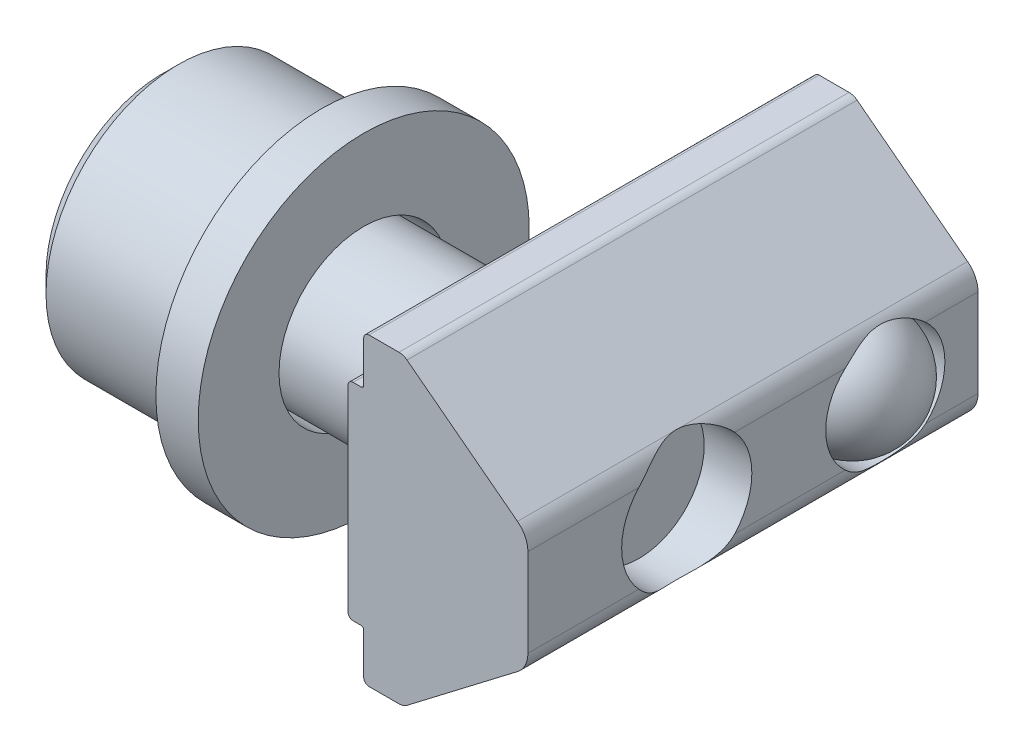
from build123d import *

# Parameters (mm, degrees)
CUT_EXTRUDE1_DEPTH       = 3
SKETCH3_R                = 6.25
SKETCH3_R_2              = 3.2
BOSS_EXTRUDE1_DEPTH      = 1.6
BOSS_EXTRUDE2_DEPTH      = 6
BOSS_EXTRUDE2_DEPTH_BACK = 11
SKETCH5_W                = 1.25
SKETCH5_H                = 2.25
SKETCH8_W                = 2.4585
SKETCH8_H                = 7.8


with BuildPart() as part:
    # Sketch1 → Revolve1 (revolve)
    with BuildSketch(Plane.XY, mode=Mode.PRIVATE) as revolve1_sk:
        Polygon((-4.6, 2.5), (-3.156624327, 0), (10.4, 0), (10.4, 3), (-1.6, 3), (-1.6, 5), (-7, 5), (-7.6, 4.4), (-7.6, 2.5), align=None)
    revolve(revolve1_sk.sketch.rotate(Axis((-3.156624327, 0, 0), (1, 0, 0)), 90), axis=Axis((-3.156624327, 0, 0), (1, 0, 0)))

    # Sketch2 → Cut-Extrude1 (cut)
    with BuildSketch(Plane.ZY.offset(7.6)):
        Polygon((0, 2.886751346), (-2.5, 1.443375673), (-2.5, -1.443375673), (0, -2.886751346), (2.5, -1.443375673), (2.5, 1.443375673), align=None)
    extrude(amount=-CUT_EXTRUDE1_DEPTH, mode=Mode.SUBTRACT)


with BuildPart() as body_2:
    # Sketch3 → Boss-Extrude1 (new body)
    with BuildSketch(Plane(origin=(0, 0, 0), x_dir=(0, 0, -1), z_dir=(1, 0, 0))):
        Circle(SKETCH3_R)
        Circle(SKETCH3_R_2, mode=Mode.SUBTRACT)
    extrude(amount=-BOSS_EXTRUDE1_DEPTH)


with BuildPart() as body_3:
    # Sketch4 → Boss-Extrude2 (new, two sides: drawn at the far end of the back side and taken through both)
    with BuildSketch(Plane.XY.offset(-BOSS_EXTRUDE2_DEPTH_BACK)):
        with BuildLine():
            Line((12.2, -1.662275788), (12.2, 1.662275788))
            ThreePointArc((12.2, 1.662275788), (12.09648877, 2.105342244), (11.807384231, 2.456683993))
            Line((11.807384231, 2.456683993), (7.634448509, 5.647204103))
            ThreePointArc((7.634448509, 5.647204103), (7.49106539, 5.723604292), (7.330756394, 5.75))
            Line((7.330756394, 5.75), (6.2, 5.75))
            ThreePointArc((6.2, 5.75), (6.058578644, 5.691421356), (6, 5.55))
            Line((6, 5.55), (6, 4))
            ThreePointArc((6, 4), (5.970710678, 3.929289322), (5.9, 3.9))
            Line((5.9, 3.9), (5.6, 3.9))
            ThreePointArc((5.6, 3.9), (5.458578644, 3.841421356), (5.4, 3.7))
            Line((5.4, 3.7), (5.4, -3.7))
            ThreePointArc((5.4, -3.7), (5.458578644, -3.841421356), (5.6, -3.9))
            Line((5.6, -3.9), (5.9, -3.9))
            ThreePointArc((5.9, -3.9), (5.970710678, -3.929289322), (6, -4))
            Line((6, -4), (6, -5.55))
            ThreePointArc((6, -5.55), (6.058578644, -5.691421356), (6.2, -5.75))
            Line((6.2, -5.75), (7.330756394, -5.75))
            ThreePointArc((7.330756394, -5.75), (7.49106539, -5.723604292), (7.634448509, -5.647204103))
            Line((7.634448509, -5.647204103), (11.807384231, -2.456683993))
            ThreePointArc((11.807384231, -2.456683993), (12.09648877, -2.105342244), (12.2, -1.662275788))
        make_face()
    extrude(amount=BOSS_EXTRUDE2_DEPTH + BOSS_EXTRUDE2_DEPTH_BACK)

    # Sketch5 → Cut-Revolve1 (revolve, cut)
    with BuildSketch(Plane(origin=(0, 0, -7.5), x_dir=(1, 0, 0), z_dir=(0, 1, 0))):
        with Locations((11.575, 1.125)):
            Rectangle(SKETCH5_W, SKETCH5_H)
    revolve(axis=Axis((12.2, 0, -7.5), (-1, 0, 0)), mode=Mode.SUBTRACT)

    # Sketch6 → Revolve2 (revolve)
    with BuildSketch(Plane(origin=(0, 0, -7.5), x_dir=(1, 0, 0), z_dir=(0, 1, 0))):
        with BuildLine():
            Line((10.95, 0), (10.95, 2.25))
            ThreePointArc((10.95, 2.25), (12.540990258, 1.590990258), (13.2, 0))
            Line((13.2, 0), (10.95, 0))
        make_face()
    revolve(axis=Axis((10.95, 0, -7.5), (1, 0, 0)))

    # Sketch8 → Tap1 (revolve, cut)
    with BuildSketch(Plane(origin=(5.4, 0, 0), x_dir=(0, 0, 1), z_dir=(0, 1, 0))):
        with Locations((1.22925, 3.9)):
            Rectangle(SKETCH8_W, SKETCH8_H)
    revolve(axis=Axis((5.4, 0, 0), (1, 0, 0)), mode=Mode.SUBTRACT)


solid = Compound([part.part, body_2.part, body_3.part])
